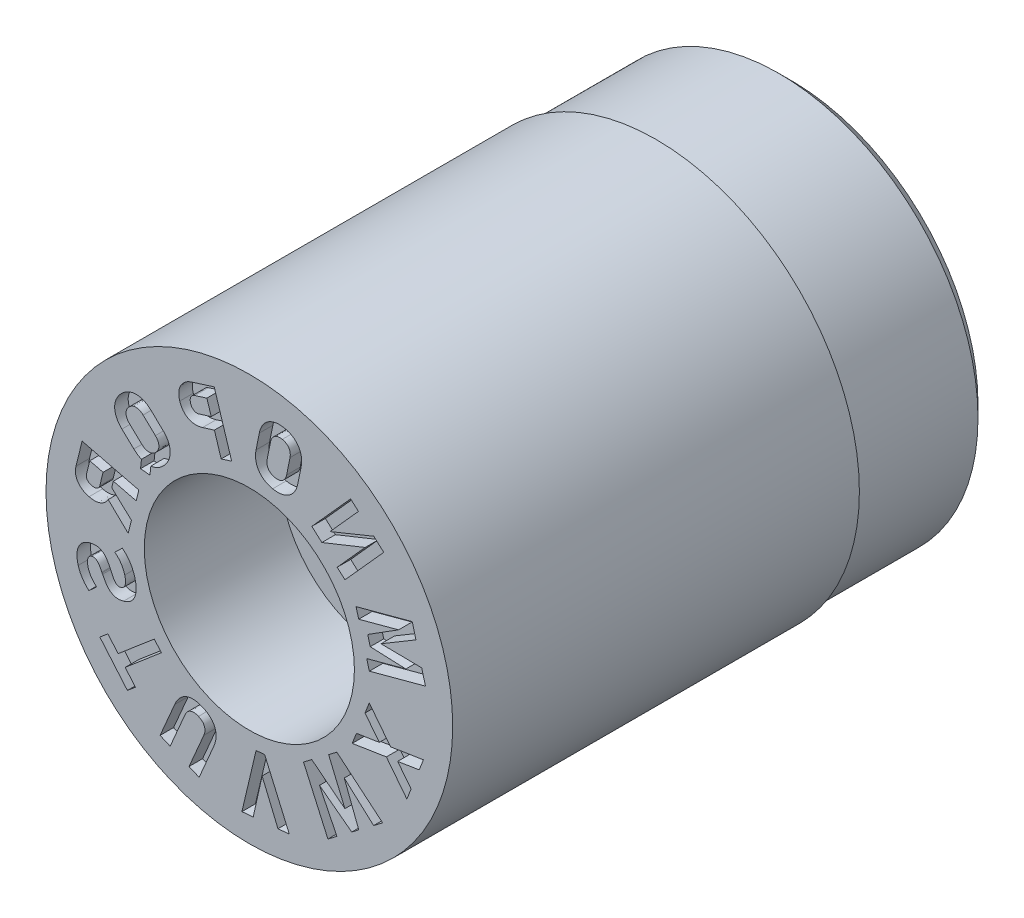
from build123d import *

# Parameters (mm, degrees)
SKETCH4_W          = 2
SKETCH4_H          = 1
CUT_EXTRUDE1_DEPTH = 0.2


with BuildPart() as part:
    # Sketch1 → Revolve1 (revolve)
    with BuildSketch(Plane(origin=(0, 0, 0), x_dir=(0, 0, -1), z_dir=(1, 0, 0)), mode=Mode.PRIVATE) as revolve1_sk:
        Polygon((0, 3), (0, 1.55), (2, 1.55), (2, 0.8), (8, 0.8), (8, 2.75), (7.75, 3), align=None)
    revolve(revolve1_sk.sketch.rotate(Axis((0, 0, 3.797909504), (0, 0, -1)), 90), axis=Axis((0, 0, 3.797909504), (0, 0, -1)))

    # Sketch4 → Cut-Revolve1 (revolve, cut)
    with BuildSketch(Plane(origin=(0, 0, 0), x_dir=(0, 0, -1), z_dir=(1, 0, 0)), mode=Mode.PRIVATE) as cut_revolve1_sk:
        with Locations((7, 3.435)):
            Rectangle(SKETCH4_W, SKETCH4_H)
    revolve(cut_revolve1_sk.sketch.rotate(Axis((0, 0, 0), (0, 0, -1)), 90), axis=Axis((0, 0, 0), (0, 0, -1)), mode=Mode.SUBTRACT)

    # Sketch6 → Cut-Extrude1 (cut)
    # profile 1 of 12: a face of its own
    with BuildSketch(Plane.XY):
        with BuildLine():
            Line((-1.46672741, 0.977625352), (-1.453354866, 1.099424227))
            add(Edge.make_bspline(
                [(-1.453354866, 1.099424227), (-1.448983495, 1.099920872), (-1.438063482, 1.1013913), (-1.420712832, 1.105088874), (-1.401352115, 1.110493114), (-1.382285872, 1.117368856), (-1.36351863, 1.125393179), (-1.345235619, 1.134792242), (-1.327460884, 1.145782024), (-1.30990065, 1.157828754), (-1.287009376, 1.176298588), (-1.270723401, 1.19150711), (-1.260450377, 1.20246643)],
                knots=[0.553389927, 0.553389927, 0.553389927, 0.553389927, 0.579785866, 0.619506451, 0.659743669, 0.700347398, 0.741058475, 0.782178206, 0.82359436, 0.866411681, 0.90990277, 1, 1, 1, 1], degree=3))
            add(Edge.make_bspline(
                [(-1.260450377, 1.20246643), (-1.250127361, 1.21340971), (-1.235586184, 1.23035848), (-1.218647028, 1.254363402), (-1.207224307, 1.272349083), (-1.197387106, 1.290811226), (-1.18882612, 1.309593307), (-1.181867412, 1.32880116), (-1.176033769, 1.348198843), (-1.171669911, 1.367740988), (-1.168675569, 1.387310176), (-1.16702959, 1.40686918), (-1.167181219, 1.426404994), (-1.168252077, 1.445885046), (-1.171250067, 1.465287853), (-1.175154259, 1.484758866), (-1.180845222, 1.504079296), (-1.187854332, 1.523146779), (-1.196124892, 1.541929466), (-1.205609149, 1.560403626), (-1.217008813, 1.57814081), (-1.229066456, 1.595917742), (-1.247831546, 1.619000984), (-1.263290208, 1.635494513), (-1.274422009, 1.645945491)],
                knots=[0, 0, 0, 0, 0.09032192, 0.133748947, 0.176264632, 0.218120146, 0.259210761, 0.300050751, 0.340644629, 0.380718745, 0.420124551, 0.459400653, 0.498379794, 0.537303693, 0.576383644, 0.616106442, 0.656423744, 0.697131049, 0.737966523, 0.779552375, 0.821614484, 0.86443419, 0.908416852, 1, 1, 1, 1], degree=3))
            Line((-1.274422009, 1.645945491), (-1.450241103, 1.812592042))
            add(Edge.make_bspline(
                [(-1.450241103, 1.812592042), (-1.461229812, 1.823174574), (-1.478424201, 1.837869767), (-1.502694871, 1.855076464), (-1.520846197, 1.866592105), (-1.539362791, 1.876736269), (-1.558312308, 1.885298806), (-1.577486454, 1.892748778), (-1.596994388, 1.898731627), (-1.616613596, 1.903190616), (-1.636229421, 1.906498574), (-1.655817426, 1.907903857), (-1.675358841, 1.90841991), (-1.694816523, 1.907020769), (-1.714293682, 1.904679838), (-1.733655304, 1.900577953), (-1.752935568, 1.895107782), (-1.77199979, 1.888326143), (-1.790678, 1.880039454), (-1.809029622, 1.870637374), (-1.826896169, 1.859784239), (-1.844349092, 1.847578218), (-1.867240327, 1.829195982), (-1.883502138, 1.813952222), (-1.893783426, 1.803004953)],
                knots=[0, 0, 0, 0, 0.091544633, 0.135456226, 0.178452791, 0.220483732, 0.262039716, 0.303154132, 0.343859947, 0.384359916, 0.423831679, 0.463100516, 0.502116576, 0.541033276, 0.580049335, 0.619764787, 0.65965471, 0.700253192, 0.741081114, 0.782195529, 0.823915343, 0.866428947, 0.909914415, 1, 1, 1, 1], degree=3))
            add(Edge.make_bspline(
                [(-1.893783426, 1.803004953), (-1.904107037, 1.792061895), (-1.918646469, 1.775112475), (-1.935588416, 1.751108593), (-1.947003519, 1.733120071), (-1.956868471, 1.714668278), (-1.965315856, 1.69587597), (-1.972639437, 1.676836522), (-1.97836159, 1.657429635), (-1.982773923, 1.637844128), (-1.985720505, 1.618262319), (-1.987316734, 1.598709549), (-1.987555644, 1.579158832), (-1.986005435, 1.559657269), (-1.983479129, 1.540127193), (-1.979167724, 1.520729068), (-1.973596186, 1.50137379), (-1.966495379, 1.482281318), (-1.95838897, 1.463419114), (-1.9486476, 1.445059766), (-1.937688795, 1.42704897), (-1.925282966, 1.40943932), (-1.906616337, 1.386253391), (-1.891083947, 1.369809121), (-1.879977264, 1.359341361)],
                knots=[0, 0, 0, 0, 0.090272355, 0.133675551, 0.176167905, 0.218000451, 0.259068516, 0.299705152, 0.340276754, 0.380328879, 0.420056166, 0.458963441, 0.497941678, 0.537199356, 0.576227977, 0.615983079, 0.656278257, 0.696963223, 0.738104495, 0.779348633, 0.821527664, 0.864508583, 0.908467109, 1, 1, 1, 1], degree=3))
            Line((-1.879977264, 1.359341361), (-1.70415817, 1.19269481))
            add(Edge.make_bspline(
                [(-1.70415817, 1.19269481), (-1.693179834, 1.182095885), (-1.675955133, 1.167448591), (-1.651760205, 1.150185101), (-1.633507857, 1.138892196), (-1.615047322, 1.128729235), (-1.600731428, 1.122212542), (-1.592652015, 1.118956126), (-1.59099072, 1.118303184)],
                knots=[0, 0, 0, 0, 0.091556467, 0.135473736, 0.178273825, 0.2203102, 0.261871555, 0.272583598, 0.272583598, 0.272583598, 0.272583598], degree=3))
            Line((-1.59099072, 1.118303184), (-1.605208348, 0.990443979))
            Line((-1.605208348, 0.990443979), (-1.46672741, 0.977625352))
        make_face()
        with BuildLine():
            Line((-1.568070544, 1.694369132), (-1.386327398, 1.52207754))
            add(Edge.make_bspline(
                [(-1.386327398, 1.52207754), (-1.376048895, 1.512396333), (-1.362465, 1.496526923), (-1.348561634, 1.47306305), (-1.341057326, 1.455098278), (-1.336122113, 1.436768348), (-1.334075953, 1.418245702), (-1.334655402, 1.399771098), (-1.3379343, 1.381400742), (-1.343762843, 1.363310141), (-1.355669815, 1.339529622), (-1.367918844, 1.323299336), (-1.377417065, 1.313343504)],
                knots=[0, 0, 0, 0, 0.179894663, 0.264485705, 0.346683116, 0.427296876, 0.505611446, 0.583343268, 0.66209559, 0.742716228, 0.82473468, 1, 1, 1, 1], degree=3))
            add(Edge.make_bspline(
                [(-1.377417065, 1.313343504), (-1.386789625, 1.303241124), (-1.402433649, 1.29024697), (-1.425483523, 1.276943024), (-1.44328031, 1.270248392), (-1.46146844, 1.266035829), (-1.47990261, 1.264438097), (-1.498466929, 1.265835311), (-1.517006, 1.269732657), (-1.535217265, 1.276413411), (-1.559677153, 1.288426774), (-1.5757122, 1.301919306), (-1.586172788, 1.311277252)],
                knots=[0, 0, 0, 0, 0.175422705, 0.257726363, 0.338312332, 0.416952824, 0.495218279, 0.573309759, 0.653557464, 0.736032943, 0.82013146, 1, 1, 1, 1], degree=3))
            Line((-1.586172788, 1.311277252), (-1.767915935, 1.483568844))
            add(Edge.make_bspline(
                [(-1.767915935, 1.483568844), (-1.778082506, 1.493358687), (-1.792089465, 1.50895573), (-1.805637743, 1.532639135), (-1.813184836, 1.550487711), (-1.818065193, 1.568769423), (-1.820392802, 1.587205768), (-1.819736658, 1.605692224), (-1.816481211, 1.624062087), (-1.810636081, 1.642146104), (-1.79877302, 1.665995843), (-1.786214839, 1.682064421), (-1.776816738, 1.69212788)],
                knots=[0, 0, 0, 0, 0.180353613, 0.264618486, 0.346827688, 0.426723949, 0.505095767, 0.582838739, 0.661602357, 0.742234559, 0.824264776, 1, 1, 1, 1], degree=3))
            add(Edge.make_bspline(
                [(-1.776816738, 1.69212788), (-1.767419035, 1.702115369), (-1.751959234, 1.715274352), (-1.728920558, 1.728513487), (-1.71112982, 1.735211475), (-1.692939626, 1.739438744), (-1.674514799, 1.740974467), (-1.655964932, 1.739812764), (-1.637404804, 1.736103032), (-1.619151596, 1.729438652), (-1.594848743, 1.716986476), (-1.578284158, 1.704163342), (-1.568070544, 1.694369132)],
                knots=[0, 0, 0, 0, 0.174779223, 0.257072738, 0.337648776, 0.416279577, 0.494535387, 0.572528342, 0.652575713, 0.735041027, 0.819501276, 1, 1, 1, 1], degree=3))
        make_face(mode=Mode.SUBTRACT)
    # profile 2 of 12: a face of its own
    with BuildSketch(Plane.XY):
        with BuildLine():
            add(Edge.make_bspline(
                [(-0.847588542, 2.475593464), (-0.871819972, 2.468104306), (-0.90635009, 2.453299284), (-0.947102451, 2.425952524), (-0.97322531, 2.402524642), (-0.995480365, 2.376552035), (-1.013828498, 2.348288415), (-1.027368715, 2.31763782), (-1.036718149, 2.285037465), (-1.041523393, 2.250930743), (-1.041433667, 2.202807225), (-1.034125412, 2.166734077), (-1.026658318, 2.143030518)],
                knots=[0, 0, 0, 0, 0.178996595, 0.263114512, 0.345347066, 0.425847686, 0.503867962, 0.582283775, 0.661421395, 0.742521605, 0.824531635, 1, 1, 1, 1], degree=3))
            add(Edge.make_bspline(
                [(-1.026658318, 2.143030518), (-1.019108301, 2.119397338), (-1.004807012, 2.085341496), (-0.976981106, 2.046061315), (-0.953669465, 2.020738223), (-0.927416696, 1.999520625), (-0.898821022, 1.982285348), (-0.867810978, 1.969408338), (-0.834698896, 1.961178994), (-0.800013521, 1.956935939), (-0.751016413, 1.957954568), (-0.714236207, 1.965480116), (-0.690063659, 1.973187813)],
                knots=[0, 0, 0, 0, 0.175719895, 0.258307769, 0.339189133, 0.418258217, 0.496075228, 0.574428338, 0.654646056, 0.73653623, 0.820715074, 1, 1, 1, 1], degree=3))
            Line((-0.690063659, 1.973187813), (-0.515575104, 2.027945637))
            Line((-0.515575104, 2.027945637), (-0.415783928, 1.709824))
            Line((-0.415783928, 1.709824), (-0.261046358, 1.758217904))
            Line((-0.261046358, 1.758217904), (-0.518463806, 2.578832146))
            Line((-0.518463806, 2.578832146), (-0.847588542, 2.475593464))
        make_face()
        with BuildLine():
            add(Edge.make_bspline(
                [(-0.740691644, 2.121022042), (-0.74948472, 2.118423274), (-0.762875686, 2.115574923), (-0.780743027, 2.115996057), (-0.793474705, 2.118187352), (-0.805799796, 2.121874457), (-0.817236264, 2.127769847), (-0.828190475, 2.134790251), (-0.837971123, 2.143868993), (-0.846973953, 2.154219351), (-0.857552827, 2.170343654), (-0.863340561, 2.183908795), (-0.866275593, 2.193441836)],
                knots=[0, 0, 0, 0, 0.169347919, 0.249424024, 0.327811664, 0.406817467, 0.485323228, 0.564064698, 0.645780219, 0.730166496, 0.816291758, 1, 1, 1, 1], degree=3))
            add(Edge.make_bspline(
                [(-0.866275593, 2.193441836), (-0.86917597, 2.203059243), (-0.87248723, 2.217544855), (-0.873056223, 2.236943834), (-0.871687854, 2.250643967), (-0.869044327, 2.263790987), (-0.864211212, 2.27590445), (-0.858100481, 2.287209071), (-0.850175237, 2.297386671), (-0.840873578, 2.306415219), (-0.82640354, 2.317248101), (-0.813530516, 2.322435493), (-0.804688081, 2.325356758)],
                knots=[0, 0, 0, 0, 0.18420078, 0.269927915, 0.354147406, 0.435878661, 0.514485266, 0.591970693, 0.670446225, 0.749567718, 0.828739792, 1, 1, 1, 1], degree=3))
            Line((-0.804688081, 2.325356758), (-0.626416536, 2.381294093))
            Line((-0.626416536, 2.381294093), (-0.562328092, 2.176988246))
            Line((-0.562328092, 2.176988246), (-0.740691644, 2.121022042))
        make_face(mode=Mode.SUBTRACT)
    # profile 3 of 12: a face of its own
    with BuildSketch(Plane.XY):
        with BuildLine():
            Line((0.147051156, 2.321248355), (0.098759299, 2.081931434))
            add(Edge.make_bspline(
                [(0.098759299, 2.081931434), (0.095700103, 2.066901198), (0.092359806, 2.044398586), (0.090523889, 2.014502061), (0.090470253, 1.992837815), (0.091764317, 1.971582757), (0.094686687, 1.950824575), (0.098541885, 1.930451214), (0.10395427, 1.910689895), (0.110451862, 1.891526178), (0.118328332, 1.873176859), (0.12736148, 1.855575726), (0.137458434, 1.838727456), (0.148980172, 1.82277698), (0.161600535, 1.807600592), (0.175196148, 1.792940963), (0.190264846, 1.779493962), (0.206194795, 1.766752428), (0.223247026, 1.755271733), (0.241085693, 1.744599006), (0.259915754, 1.735138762), (0.279669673, 1.726856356), (0.307503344, 1.716834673), (0.32931022, 1.711330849), (0.344190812, 1.708334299)],
                knots=[0, 0, 0, 0, 0.091385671, 0.135312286, 0.178368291, 0.220399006, 0.262067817, 0.303195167, 0.34386033, 0.384041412, 0.423675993, 0.462717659, 0.501847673, 0.540591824, 0.579825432, 0.619409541, 0.659590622, 0.700042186, 0.740864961, 0.781970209, 0.82383339, 0.866300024, 0.909531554, 1, 1, 1, 1], degree=3))
            add(Edge.make_bspline(
                [(0.344190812, 1.708334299), (0.359067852, 1.705368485), (0.381352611, 1.702132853), (0.41092311, 1.700341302), (0.432423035, 1.700505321), (0.453440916, 1.70172503), (0.474023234, 1.704643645), (0.494148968, 1.708585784), (0.513806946, 1.714016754), (0.532774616, 1.720804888), (0.551086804, 1.728755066), (0.56861703, 1.737868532), (0.585424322, 1.748147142), (0.601378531, 1.759729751), (0.616503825, 1.772559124), (0.630763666, 1.786604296), (0.644431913, 1.801535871), (0.656902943, 1.817807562), (0.66858168, 1.834900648), (0.679041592, 1.853061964), (0.6886295, 1.872005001), (0.697035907, 1.891970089), (0.706916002, 1.920237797), (0.712387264, 1.942353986), (0.715515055, 1.957390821)],
                knots=[0, 0, 0, 0, 0.090342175, 0.133925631, 0.176326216, 0.218342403, 0.259220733, 0.300045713, 0.340423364, 0.380566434, 0.41994669, 0.459242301, 0.498155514, 0.537183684, 0.576554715, 0.616169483, 0.656336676, 0.697019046, 0.738168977, 0.779559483, 0.821755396, 0.864555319, 0.908487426, 1, 1, 1, 1], degree=3))
            Line((0.715515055, 1.957390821), (0.763806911, 2.196707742))
            add(Edge.make_bspline(
                [(0.763806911, 2.196707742), (0.766864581, 2.211737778), (0.770209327, 2.234240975), (0.772038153, 2.264136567), (0.772111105, 2.285803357), (0.770748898, 2.307019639), (0.768089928, 2.327782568), (0.764171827, 2.348118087), (0.758775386, 2.367880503), (0.752281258, 2.387048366), (0.744343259, 2.405456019), (0.735391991, 2.423161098), (0.724990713, 2.439914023), (0.713727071, 2.455967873), (0.701225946, 2.471200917), (0.68746857, 2.485602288), (0.672475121, 2.499088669), (0.656529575, 2.511815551), (0.639481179, 2.523299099), (0.62164297, 2.533975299), (0.602807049, 2.543418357), (0.583019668, 2.551791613), (0.555001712, 2.561477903), (0.53321537, 2.567225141), (0.518307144, 2.570143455)],
                knots=[0, 0, 0, 0, 0.091366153, 0.135283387, 0.178330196, 0.220351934, 0.261835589, 0.302954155, 0.343610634, 0.383783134, 0.423409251, 0.462932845, 0.5018512, 0.540769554, 0.579686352, 0.619122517, 0.659295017, 0.699737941, 0.740551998, 0.781648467, 0.823502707, 0.865960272, 0.909550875, 1, 1, 1, 1], degree=3))
            add(Edge.make_bspline(
                [(0.518307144, 2.570143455), (0.503424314, 2.572894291), (0.481263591, 2.57665504), (0.451693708, 2.578164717), (0.430247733, 2.578199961), (0.409236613, 2.576803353), (0.388703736, 2.573937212), (0.368579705, 2.569980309), (0.348917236, 2.564563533), (0.329927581, 2.557720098), (0.31156222, 2.549917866), (0.293904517, 2.540942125), (0.277199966, 2.530485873), (0.261240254, 2.518930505), (0.246079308, 2.506221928), (0.23182187, 2.492165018), (0.218183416, 2.477133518), (0.20565905, 2.460835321), (0.193985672, 2.443737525), (0.183524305, 2.425577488), (0.173936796, 2.4066341), (0.16553028, 2.386669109), (0.155650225, 2.358401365), (0.150178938, 2.336285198), (0.147051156, 2.321248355)],
                knots=[0, 0, 0, 0, 0.090258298, 0.133520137, 0.176246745, 0.21795782, 0.258841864, 0.299672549, 0.340055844, 0.380204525, 0.419830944, 0.458864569, 0.498066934, 0.537100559, 0.576166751, 0.615787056, 0.656288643, 0.696976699, 0.738132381, 0.779528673, 0.821730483, 0.864536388, 0.908474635, 1, 1, 1, 1], degree=3))
        make_face()
        with BuildLine():
            Line((0.599795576, 2.234089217), (0.549816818, 1.986732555))
            add(Edge.make_bspline(
                [(0.549816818, 1.986732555), (0.547220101, 1.972713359), (0.540747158, 1.952712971), (0.528291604, 1.928185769), (0.516871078, 1.912261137), (0.504000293, 1.898116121), (0.489236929, 1.88662854), (0.473268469, 1.877044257), (0.455788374, 1.869967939), (0.437082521, 1.865599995), (0.410396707, 1.862586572), (0.389914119, 1.864943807), (0.376302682, 1.867533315)],
                knots=[0, 0, 0, 0, 0.179817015, 0.264259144, 0.346675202, 0.42679663, 0.505118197, 0.582211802, 0.661577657, 0.742363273, 0.82434151, 1, 1, 1, 1], degree=3))
            add(Edge.make_bspline(
                [(0.376302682, 1.867533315), (0.36278716, 1.870331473), (0.343281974, 1.876530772), (0.319740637, 1.889179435), (0.304437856, 1.900678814), (0.291126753, 1.913913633), (0.279944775, 1.928836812), (0.270953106, 1.945281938), (0.264451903, 1.963252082), (0.260105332, 1.982346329), (0.25803718, 2.009792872), (0.259813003, 2.030756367), (0.262838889, 2.044711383)],
                knots=[0, 0, 0, 0, 0.174710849, 0.257203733, 0.337202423, 0.416168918, 0.494050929, 0.572475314, 0.652528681, 0.735233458, 0.819588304, 1, 1, 1, 1], degree=3))
            Line((0.262838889, 2.044711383), (0.312817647, 2.292068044))
            add(Edge.make_bspline(
                [(0.312817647, 2.292068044), (0.315873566, 2.305922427), (0.321671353, 2.326198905), (0.334529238, 2.350468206), (0.345886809, 2.366353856), (0.358729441, 2.380455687), (0.373555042, 2.391987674), (0.389566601, 2.401605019), (0.40711949, 2.408455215), (0.425678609, 2.413027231), (0.452268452, 2.415932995), (0.472670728, 2.413698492), (0.486195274, 2.410944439)],
                knots=[0, 0, 0, 0, 0.180046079, 0.264695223, 0.346531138, 0.426790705, 0.505247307, 0.583508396, 0.662489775, 0.74282089, 0.824940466, 1, 1, 1, 1], degree=3))
            add(Edge.make_bspline(
                [(0.486195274, 2.410944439), (0.499817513, 2.40830873), (0.519394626, 2.402075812), (0.543024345, 2.38934964), (0.558426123, 2.377878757), (0.571674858, 2.364624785), (0.582980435, 2.349836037), (0.591689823, 2.333290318), (0.598353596, 2.315371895), (0.602309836, 2.296262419), (0.605098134, 2.268964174), (0.602501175, 2.248013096), (0.599795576, 2.234089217)],
                knots=[0, 0, 0, 0, 0.175547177, 0.258039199, 0.338755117, 0.417720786, 0.494591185, 0.573477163, 0.653529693, 0.735805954, 0.819854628, 1, 1, 1, 1], degree=3))
        make_face(mode=Mode.SUBTRACT)
    # profile 4 of 12: a face of its own
    with BuildSketch(Plane.XY):
        Polygon((1.295697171, 1.181577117), (1.410660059, 1.078360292), (1.983030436, 1.71555984), (1.835920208, 1.847611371), (1.189748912, 1.584151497), (1.609290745, 2.0512231), (1.494327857, 2.154439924), (0.92195748, 1.517240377), (1.06983895, 1.38456587), (1.708463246, 1.64105352), align=None)
    # profile 5 of 12: a face of its own
    with BuildSketch(Plane.XY):
        Polygon((2.543046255, 0.519458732), (1.942496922, 0.527115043), (2.458076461, 0.834968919), (2.402746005, 1.040468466), (1.574712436, 0.817679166), (1.612958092, 0.675998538), (2.200981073, 0.834187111), (1.746234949, 0.548202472), (1.783307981, 0.410298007), (2.30911228, 0.388077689), (1.732097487, 0.232850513), (1.770191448, 0.091082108), (2.598225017, 0.313871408), align=None)
    # profile 6 of 12: a face of its own
    with BuildSketch(Plane.XY):
        Polygon((1.580155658, -0.798276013), (1.517642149, -0.958065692), (2.021506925, -0.878658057), (2.323979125, -1.266242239), (2.386621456, -1.106571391), (2.188066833, -0.852431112), (2.50570009, -0.802487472), (2.5682136, -0.642697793), (2.083642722, -0.718964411), (1.769299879, -0.315617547), (1.706667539, -0.475536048), (1.917295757, -0.745160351), align=None)
    # profile 7 of 12: a face of its own
    with BuildSketch(Plane.XY):
        Polygon((1.291971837, -2.259149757), (1.03450654, -1.735665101), (1.510847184, -2.093672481), (1.614684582, -2.015266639), (1.40029279, -1.459362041), (1.833559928, -1.849789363), (1.966409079, -1.749368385), (1.291030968, -1.183556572), (1.169550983, -1.275359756), (1.409635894, -1.846016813), (0.920798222, -1.463335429), (0.799101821, -1.555259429), (1.158954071, -2.359522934), align=None)
    # profile 8 of 12: a face of its own
    with BuildSketch(Plane.XY):
        Polygon((0.226078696, -1.746816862), (0.099385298, -1.758251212), (-0.109836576, -2.64380862), (0.057007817, -2.628878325), (0.188253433, -2.038922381), (0.422413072, -2.596151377), (0.589257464, -2.581221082), align=None)
    # profile 9 of 12: a face of its own
    with BuildSketch(Plane.XY):
        with BuildLine():
            Line((-0.741126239, -2.521020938), (-0.524976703, -2.017571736))
            add(Edge.make_bspline(
                [(-0.524976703, -2.017571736), (-0.518559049, -2.002641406), (-0.509994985, -1.980244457), (-0.501458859, -1.949979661), (-0.496319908, -1.928130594), (-0.492811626, -1.90664198), (-0.490529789, -1.8855929), (-0.489905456, -1.864898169), (-0.490512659, -1.844531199), (-0.492772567, -1.824685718), (-0.496157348, -1.805335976), (-0.501147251, -1.786605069), (-0.507466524, -1.768452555), (-0.515161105, -1.750867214), (-0.524029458, -1.733746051), (-0.534609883, -1.717329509), (-0.546467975, -1.701455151), (-0.559721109, -1.686340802), (-0.573989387, -1.671619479), (-0.58980657, -1.657908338), (-0.606746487, -1.644722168), (-0.625226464, -1.63266475), (-0.651633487, -1.616646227), (-0.673024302, -1.606619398), (-0.687654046, -1.600231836)],
                knots=[0, 0, 0, 0, 0.095757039, 0.140963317, 0.185152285, 0.227891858, 0.269135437, 0.309771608, 0.349751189, 0.389049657, 0.427322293, 0.465359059, 0.503094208, 0.540431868, 0.578340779, 0.616539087, 0.655338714, 0.694949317, 0.734872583, 0.775996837, 0.818144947, 0.861218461, 0.905887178, 1, 1, 1, 1], degree=3))
            add(Edge.make_bspline(
                [(-0.687654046, -1.600231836), (-0.702304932, -1.593935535), (-0.72438137, -1.585706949), (-0.754051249, -1.577019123), (-0.775615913, -1.572430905), (-0.796792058, -1.56903822), (-0.817570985, -1.567158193), (-0.838024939, -1.566475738), (-0.858009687, -1.567681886), (-0.87760867, -1.569898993), (-0.896690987, -1.573751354), (-0.915235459, -1.579025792), (-0.933311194, -1.585380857), (-0.950692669, -1.593433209), (-0.967510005, -1.602879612), (-0.983946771, -1.613509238), (-0.999662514, -1.625829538), (-1.014673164, -1.639433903), (-1.029288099, -1.654078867), (-1.042863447, -1.670343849), (-1.056191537, -1.687574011), (-1.068436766, -1.70641042), (-1.08431408, -1.733516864), (-1.094691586, -1.755164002), (-1.101096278, -1.770080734)],
                knots=[0, 0, 0, 0, 0.094052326, 0.138857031, 0.182257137, 0.224032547, 0.265305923, 0.305273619, 0.344637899, 0.383308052, 0.421558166, 0.459328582, 0.496982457, 0.5344751, 0.572174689, 0.610707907, 0.649837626, 0.689830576, 0.73017837, 0.771778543, 0.81472744, 0.858617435, 0.904207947, 1, 1, 1, 1], degree=3))
            Line((-1.101096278, -1.770080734), (-1.317245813, -2.273529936))
            Line((-1.317245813, -2.273529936), (-1.168590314, -2.337418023))
            Line((-1.168590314, -2.337418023), (-0.950853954, -1.830292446))
            add(Edge.make_bspline(
                [(-0.950853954, -1.830292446), (-0.946191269, -1.819627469), (-0.938574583, -1.804325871), (-0.926177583, -1.785855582), (-0.916315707, -1.773820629), (-0.905705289, -1.763244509), (-0.894381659, -1.754157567), (-0.882257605, -1.746659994), (-0.869560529, -1.74034872), (-0.856190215, -1.735643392), (-0.842328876, -1.73255568), (-0.828071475, -1.730857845), (-0.813400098, -1.731166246), (-0.798286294, -1.732641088), (-0.776981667, -1.736981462), (-0.761282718, -1.742852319), (-0.750752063, -1.74717303)],
                knots=[0, 0, 0, 0, 0.141764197, 0.207321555, 0.270382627, 0.330840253, 0.389360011, 0.446675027, 0.504025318, 0.561639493, 0.618711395, 0.676592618, 0.735931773, 0.796938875, 0.861250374, 1, 1, 1, 1], degree=3))
            add(Edge.make_bspline(
                [(-0.750752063, -1.74717303), (-0.740126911, -1.75149461), (-0.725322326, -1.759428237), (-0.70717646, -1.771609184), (-0.695636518, -1.781652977), (-0.685192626, -1.792154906), (-0.676557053, -1.803776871), (-0.668989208, -1.815892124), (-0.663364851, -1.828933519), (-0.658952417, -1.842444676), (-0.656136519, -1.856498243), (-0.654691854, -1.870997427), (-0.655275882, -1.885982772), (-0.656959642, -1.90142979), (-0.661794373, -1.92316214), (-0.667396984, -1.939304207), (-0.672045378, -1.950007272)],
                knots=[0, 0, 0, 0, 0.138812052, 0.203283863, 0.264542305, 0.324055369, 0.382496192, 0.439743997, 0.496882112, 0.554235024, 0.611832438, 0.670363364, 0.730476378, 0.793336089, 0.85857402, 1, 1, 1, 1], degree=3))
            Line((-0.672045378, -1.950007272), (-0.889781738, -2.45713285))
            Line((-0.889781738, -2.45713285), (-0.741126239, -2.521020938))
        make_face()
    # profile 10 of 12: a face of its own
    with BuildSketch(Plane.XY):
        Polygon((-1.936121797, -1.538560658), (-2.087028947, -1.36093086), (-2.205548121, -1.461685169), (-1.799150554, -1.940047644), (-1.68063138, -1.839293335), (-1.83170054, -1.661472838), (-1.297750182, -1.207787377), (-1.402230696, -1.084925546), align=None)
    # profile 11 of 12: a face of its own
    with BuildSketch(Plane.XY):
        with BuildLine():
            add(Edge.make_bspline(
                [(-1.689018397, -0.44431533), (-1.694063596, -0.424678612), (-1.703837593, -0.395991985), (-1.719006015, -0.358642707), (-1.732059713, -0.331701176), (-1.746350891, -0.305711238), (-1.761502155, -0.28067129), (-1.778114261, -0.257030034), (-1.795692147, -0.23460493), (-1.814318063, -0.21369807), (-1.839823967, -0.18782828), (-1.860998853, -0.171032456), (-1.87538532, -0.160552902)],
                knots=[0, 0, 0, 0, 0.175598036, 0.262483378, 0.349340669, 0.434959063, 0.519564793, 0.602928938, 0.685299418, 0.766451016, 0.845566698, 1, 1, 1, 1], degree=3))
            Line((-1.87538532, -0.160552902), (-1.984668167, -0.267366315))
            add(Edge.make_bspline(
                [(-1.984668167, -0.267366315), (-1.967310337, -0.279967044), (-1.942600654, -0.301266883), (-1.913952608, -0.334334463), (-1.894042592, -0.361475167), (-1.876029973, -0.390265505), (-1.855738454, -0.430797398), (-1.843888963, -0.462645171), (-1.838265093, -0.484552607)],
                knots=[0, 0, 0, 0, 0.241135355, 0.364898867, 0.491079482, 0.619191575, 0.7461354, 1, 1, 1, 1], degree=3))
            add(Edge.make_bspline(
                [(-1.838265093, -0.484552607), (-1.835243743, -0.496605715), (-1.830881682, -0.51429017), (-1.827640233, -0.537641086), (-1.826367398, -0.553827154), (-1.82626998, -0.569129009), (-1.826863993, -0.583620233), (-1.829015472, -0.597241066), (-1.832118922, -0.609974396), (-1.836196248, -0.621763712), (-1.841504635, -0.632338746), (-1.847643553, -0.641863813), (-1.85471113, -0.650379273), (-1.863188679, -0.65740769), (-1.87586716, -0.665580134), (-1.886569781, -0.669905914), (-1.894092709, -0.671800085)],
                knots=[0, 0, 0, 0, 0.170512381, 0.249193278, 0.322989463, 0.392929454, 0.458909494, 0.521578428, 0.581623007, 0.638439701, 0.692198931, 0.743422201, 0.793582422, 0.843228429, 0.893745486, 1, 1, 1, 1], degree=3))
            Line((-1.894092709, -0.671800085), (-1.894787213, -0.671999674))
            add(Edge.make_bspline(
                [(-1.894787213, -0.671999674), (-1.904727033, -0.674915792), (-1.919936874, -0.676613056), (-1.939442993, -0.673216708), (-1.952451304, -0.667703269), (-1.964165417, -0.659796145), (-1.975054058, -0.65023313), (-1.985005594, -0.638910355), (-1.994176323, -0.625684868), (-2.003022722, -0.610515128), (-2.015778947, -0.586331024), (-2.02505569, -0.566864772), (-2.031089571, -0.553058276)],
                knots=[0, 0, 0, 0, 0.155056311, 0.22522927, 0.2945672, 0.36503987, 0.436189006, 0.511218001, 0.590319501, 0.676993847, 0.774232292, 1, 1, 1, 1], degree=3))
            add(Edge.make_bspline(
                [(-2.031089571, -0.553058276), (-2.031672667, -0.552117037), (-2.0328119, -0.55015588), (-2.033141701, -0.54788969), (-2.033971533, -0.547031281)],
                knots=[0, 0, 0, 0, 0.497855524, 1, 1, 1, 1], degree=3))
            Line((-2.033971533, -0.547031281), (-2.039104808, -0.535017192))
            add(Edge.make_bspline(
                [(-2.039104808, -0.535017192), (-2.050337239, -0.510750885), (-2.066238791, -0.47569211), (-2.091038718, -0.43343829), (-2.108067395, -0.40612423), (-2.127284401, -0.382417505), (-2.149232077, -0.36186957), (-2.174845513, -0.345139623), (-2.198095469, -0.333325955), (-2.21828809, -0.325914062), (-2.234703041, -0.322153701), (-2.252068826, -0.319916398), (-2.270427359, -0.318920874), (-2.289728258, -0.319872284), (-2.317531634, -0.322819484), (-2.338638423, -0.327439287), (-2.352884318, -0.331302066)],
                knots=[0, 0, 0, 0, 0.190837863, 0.273710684, 0.349180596, 0.42004136, 0.490645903, 0.562536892, 0.637382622, 0.676094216, 0.715571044, 0.757136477, 0.800799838, 0.846438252, 0.894726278, 1, 1, 1, 1], degree=3))
            Line((-2.352884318, -0.331302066), (-2.353427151, -0.331413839))
            add(Edge.make_bspline(
                [(-2.353427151, -0.331413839), (-2.366363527, -0.334795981), (-2.385138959, -0.341128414), (-2.408866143, -0.351578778), (-2.425455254, -0.36007851), (-2.440923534, -0.36962426), (-2.4553371, -0.380253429), (-2.468769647, -0.391658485), (-2.481231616, -0.40388774), (-2.492425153, -0.417125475), (-2.502591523, -0.431133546), (-2.511744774, -0.445952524), (-2.519564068, -0.461652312), (-2.526399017, -0.478039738), (-2.532153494, -0.495195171), (-2.536619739, -0.513159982), (-2.540096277, -0.531904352), (-2.542276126, -0.551356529), (-2.543461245, -0.571452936), (-2.543191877, -0.592158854), (-2.542011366, -0.613524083), (-2.539505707, -0.635566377), (-2.534622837, -0.666328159), (-2.529339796, -0.689494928), (-2.525129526, -0.70503214)],
                knots=[0, 0, 0, 0, 0.085942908, 0.127134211, 0.1666203, 0.205702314, 0.243865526, 0.281662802, 0.318926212, 0.355994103, 0.392989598, 0.430133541, 0.4678486, 0.505638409, 0.544226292, 0.584071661, 0.624570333, 0.66671655, 0.709848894, 0.753924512, 0.799785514, 0.847384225, 0.896494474, 1, 1, 1, 1], degree=3))
            add(Edge.make_bspline(
                [(-2.525129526, -0.70503214), (-2.521334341, -0.720103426), (-2.513569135, -0.74228467), (-2.501359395, -0.771390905), (-2.487130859, -0.800637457), (-2.466126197, -0.836073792), (-2.427148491, -0.889904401), (-2.392228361, -0.92589678), (-2.366887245, -0.947563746)],
                knots=[0, 0, 0, 0, 0.158506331, 0.239681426, 0.322226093, 0.490467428, 0.659591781, 1, 1, 1, 1], degree=3))
            Line((-2.366887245, -0.947563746), (-2.252575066, -0.845939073))
            add(Edge.make_bspline(
                [(-2.252575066, -0.845939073), (-2.267596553, -0.833184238), (-2.288776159, -0.812812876), (-2.31416725, -0.783291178), (-2.331068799, -0.760308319), (-2.345937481, -0.736770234), (-2.362530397, -0.705666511), (-2.371394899, -0.681192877), (-2.376034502, -0.664882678)],
                knots=[0, 0, 0, 0, 0.265836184, 0.395703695, 0.52496937, 0.650390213, 0.771085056, 1, 1, 1, 1], degree=3))
            add(Edge.make_bspline(
                [(-2.376034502, -0.664882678), (-2.37896652, -0.653563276), (-2.382926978, -0.636957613), (-2.386145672, -0.615088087), (-2.387390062, -0.599926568), (-2.387691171, -0.585590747), (-2.386939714, -0.572026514), (-2.385271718, -0.559351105), (-2.382536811, -0.54749034), (-2.378754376, -0.536632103), (-2.374095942, -0.526768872), (-2.36855987, -0.517942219), (-2.361909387, -0.510291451), (-2.354540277, -0.503434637), (-2.342889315, -0.496089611), (-2.333328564, -0.4919094), (-2.326417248, -0.490344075)],
                knots=[0, 0, 0, 0, 0.172982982, 0.252068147, 0.326646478, 0.397798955, 0.463928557, 0.5273449, 0.586625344, 0.643594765, 0.697028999, 0.747644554, 0.797096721, 0.846571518, 0.895880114, 1, 1, 1, 1], degree=3))
            Line((-2.326417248, -0.490344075), (-2.325962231, -0.490080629))
            add(Edge.make_bspline(
                [(-2.325962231, -0.490080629), (-2.315076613, -0.486958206), (-2.298565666, -0.485054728), (-2.277366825, -0.488791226), (-2.263524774, -0.495047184), (-2.250921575, -0.503390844), (-2.239259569, -0.513216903), (-2.228743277, -0.524689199), (-2.219290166, -0.538184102), (-2.209713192, -0.553866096), (-2.194853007, -0.580126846), (-2.183894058, -0.601721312), (-2.176288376, -0.617076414)],
                knots=[0, 0, 0, 0, 0.157037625, 0.226588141, 0.296143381, 0.366113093, 0.435857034, 0.50725385, 0.58138266, 0.664104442, 0.762196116, 1, 1, 1, 1], degree=3))
            add(Edge.make_bspline(
                [(-2.176288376, -0.617076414), (-2.175427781, -0.61843289), (-2.174538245, -0.621559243), (-2.172908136, -0.62437091), (-2.172065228, -0.625769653)],
                knots=[0, 0, 0, 0, 0.492330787, 1, 1, 1, 1], degree=3))
            add(Edge.make_bspline(
                [(-2.172065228, -0.625769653), (-2.171150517, -0.627861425), (-2.169233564, -0.632084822), (-2.166662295, -0.635945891), (-2.165734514, -0.638103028)],
                knots=[0, 0, 0, 0, 0.494321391, 1, 1, 1, 1], degree=3))
            add(Edge.make_bspline(
                [(-2.165734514, -0.638103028), (-2.154464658, -0.661079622), (-2.137365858, -0.693849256), (-2.111938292, -0.733652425), (-2.094045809, -0.759420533), (-2.074257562, -0.781752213), (-2.051809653, -0.800633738), (-2.026687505, -0.816538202), (-2.003613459, -0.826902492), (-1.983898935, -0.833492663), (-1.96804642, -0.836895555), (-1.951408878, -0.838827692), (-1.933965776, -0.839434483), (-1.915644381, -0.83888937), (-1.889557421, -0.835408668), (-1.869753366, -0.831367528), (-1.85642575, -0.827800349)],
                knots=[0, 0, 0, 0, 0.189876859, 0.273553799, 0.350149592, 0.422278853, 0.494078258, 0.566932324, 0.642065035, 0.681025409, 0.720888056, 0.762040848, 0.805066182, 0.850219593, 0.897771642, 1, 1, 1, 1], degree=3))
            Line((-1.85642575, -0.827800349), (-1.855340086, -0.827576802))
            add(Edge.make_bspline(
                [(-1.855340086, -0.827576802), (-1.842678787, -0.823967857), (-1.823997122, -0.818071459), (-1.800640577, -0.807405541), (-1.784233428, -0.798927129), (-1.76914114, -0.788995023), (-1.75484743, -0.778441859), (-1.741729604, -0.766662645), (-1.729456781, -0.75419842), (-1.718464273, -0.740640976), (-1.708394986, -0.726343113), (-1.699642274, -0.711055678), (-1.691874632, -0.695048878), (-1.685319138, -0.678182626), (-1.680010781, -0.660477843), (-1.675736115, -0.641957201), (-1.67248457, -0.622678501), (-1.67057502, -0.602611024), (-1.669568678, -0.581902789), (-1.670076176, -0.560559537), (-1.671316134, -0.538544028), (-1.674054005, -0.5158631), (-1.67918986, -0.484173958), (-1.68467892, -0.4603151), (-1.689018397, -0.44431533)],
                knots=[0, 0, 0, 0, 0.08355466, 0.12375728, 0.162670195, 0.200489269, 0.238155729, 0.275196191, 0.312127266, 0.348926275, 0.385706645, 0.422867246, 0.460460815, 0.498401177, 0.537440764, 0.57752723, 0.618826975, 0.661274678, 0.705242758, 0.750168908, 0.79654163, 0.844974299, 0.894907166, 1, 1, 1, 1], degree=3))
        make_face()
    # profile 12 of 12: a face of its own
    with BuildSketch(Plane.XY):
        with BuildLine():
            add(Edge.make_bspline(
                [(-2.557748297, 0.545531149), (-2.563061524, 0.523751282), (-2.567711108, 0.490642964), (-2.564264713, 0.447138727), (-2.557464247, 0.416445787), (-2.546539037, 0.387373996), (-2.531230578, 0.360486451), (-2.512191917, 0.335635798), (-2.489221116, 0.313221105), (-2.462829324, 0.293201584), (-2.422218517, 0.270128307), (-2.388332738, 0.25851616), (-2.364878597, 0.252584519)],
                knots=[0, 0, 0, 0, 0.170629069, 0.251442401, 0.330524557, 0.408845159, 0.486560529, 0.564834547, 0.646023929, 0.729751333, 0.815947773, 1, 1, 1, 1], degree=3))
            add(Edge.make_bspline(
                [(-2.364878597, 0.252584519), (-2.341309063, 0.246743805), (-2.305837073, 0.241369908), (-2.25917102, 0.242966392), (-2.226568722, 0.248253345), (-2.195895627, 0.257543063), (-2.167374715, 0.270488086), (-2.14144077, 0.28756982), (-2.118212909, 0.308272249), (-2.098025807, 0.331570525), (-2.087201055, 0.348870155), (-2.082437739, 0.357576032)],
                knots=[0, 0, 0, 0, 0.184714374, 0.270645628, 0.35404827, 0.435069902, 0.513594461, 0.591323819, 0.670175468, 0.74946487, 0.824817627, 0.824817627, 0.824817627, 0.824817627], degree=3))
            Line((-2.082437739, 0.357576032), (-1.78717157, 0.07263952))
            Line((-1.78717157, 0.07263952), (-1.739951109, 0.263392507))
            Line((-1.739951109, 0.263392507), (-2.029797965, 0.534897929))
            Line((-2.029797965, 0.534897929), (-2.006140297, 0.630544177))
            Line((-2.006140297, 0.630544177), (-1.669750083, 0.547378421))
            Line((-1.669750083, 0.547378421), (-1.630858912, 0.704897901))
            Line((-1.630858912, 0.704897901), (-2.467212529, 0.911669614))
            Line((-2.467212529, 0.911669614), (-2.557748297, 0.545531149))
        make_face()
        with BuildLine():
            add(Edge.make_bspline(
                [(-2.206407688, 0.472059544), (-2.208385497, 0.464435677), (-2.212416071, 0.453347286), (-2.221042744, 0.440488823), (-2.228799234, 0.432236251), (-2.237677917, 0.425129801), (-2.247643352, 0.419447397), (-2.258654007, 0.415097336), (-2.270615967, 0.412230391), (-2.28339387, 0.410556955), (-2.301666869, 0.410458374), (-2.315525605, 0.412569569), (-2.324801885, 0.414627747)],
                knots=[0, 0, 0, 0, 0.160420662, 0.236858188, 0.313184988, 0.38973308, 0.467132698, 0.545428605, 0.629531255, 0.71648509, 0.806786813, 1, 1, 1, 1], degree=3))
            add(Edge.make_bspline(
                [(-2.324801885, 0.414627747), (-2.334033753, 0.416951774), (-2.34725262, 0.421459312), (-2.363454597, 0.429830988), (-2.373982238, 0.437131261), (-2.383161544, 0.445317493), (-2.391054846, 0.454177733), (-2.39718312, 0.463941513), (-2.401725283, 0.474376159), (-2.404824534, 0.485287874), (-2.40634671, 0.50088396), (-2.405010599, 0.512762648), (-2.403015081, 0.520569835)],
                knots=[0, 0, 0, 0, 0.192838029, 0.281594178, 0.368637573, 0.451586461, 0.530263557, 0.608207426, 0.683982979, 0.760173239, 0.836976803, 1, 1, 1, 1], degree=3))
            Line((-2.403015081, 0.520569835), (-2.35447312, 0.716662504))
            Line((-2.35447312, 0.716662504), (-2.157888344, 0.668060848))
            Line((-2.157888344, 0.668060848), (-2.206407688, 0.472059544))
        make_face(mode=Mode.SUBTRACT)
    extrude(amount=-CUT_EXTRUDE1_DEPTH, mode=Mode.SUBTRACT)


solid = part.part
